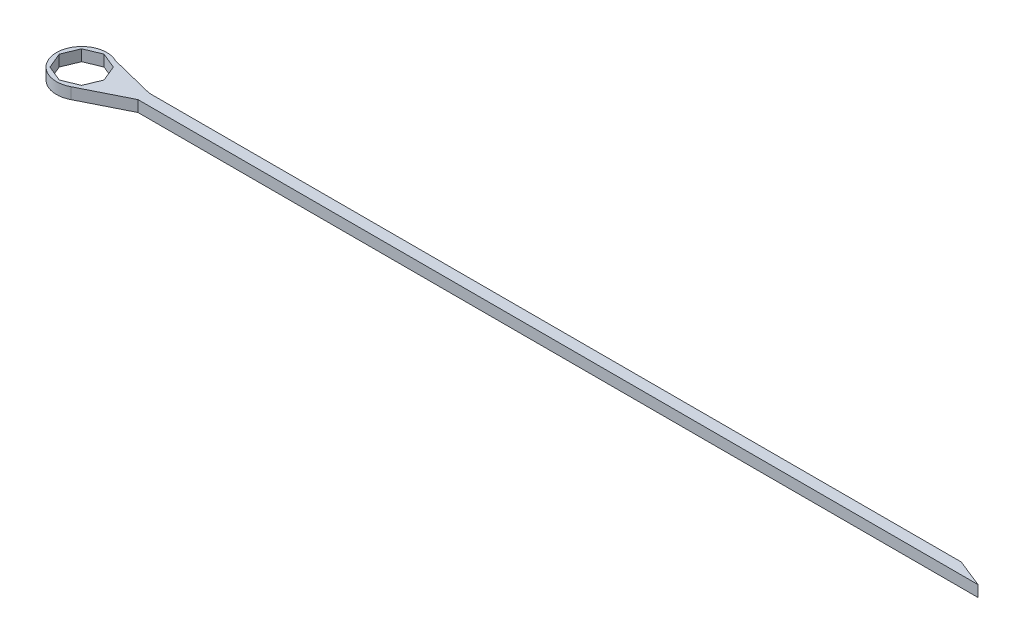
from build123d import *

# Parameters (mm, degrees)
BOSS_EXTRUDE1_DEPTH = 1


with BuildPart() as part:
    # Sketch1 → Boss-Extrude1 (new body)
    with BuildSketch(Plane(origin=(0, 0, 0), x_dir=(1, 0, 0), z_dir=(0, 1, 0))):
        with BuildLine():
            Line((5.030776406, 0), (80, 0))
            Line((80, 0), (77.5, 1))
            Line((77.5, 1), (5.030776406, 1))
            Line((5.030776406, 1), (1.030776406, 2))
            ThreePointArc((1.030776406, 2), (-2.25, 0), (1.030776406, -2))
            Line((1.030776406, -2), (5.030776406, 0))
        make_face()
        Polygon((2, 0), (1.414213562, 1.414213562), (0, 2), (-1.414213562, 1.414213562), (-2, 0), (-1.414213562, -1.414213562), (0, -2), (1.414213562, -1.414213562), align=None, mode=Mode.SUBTRACT)
    extrude(amount=BOSS_EXTRUDE1_DEPTH)


solid = part.part
